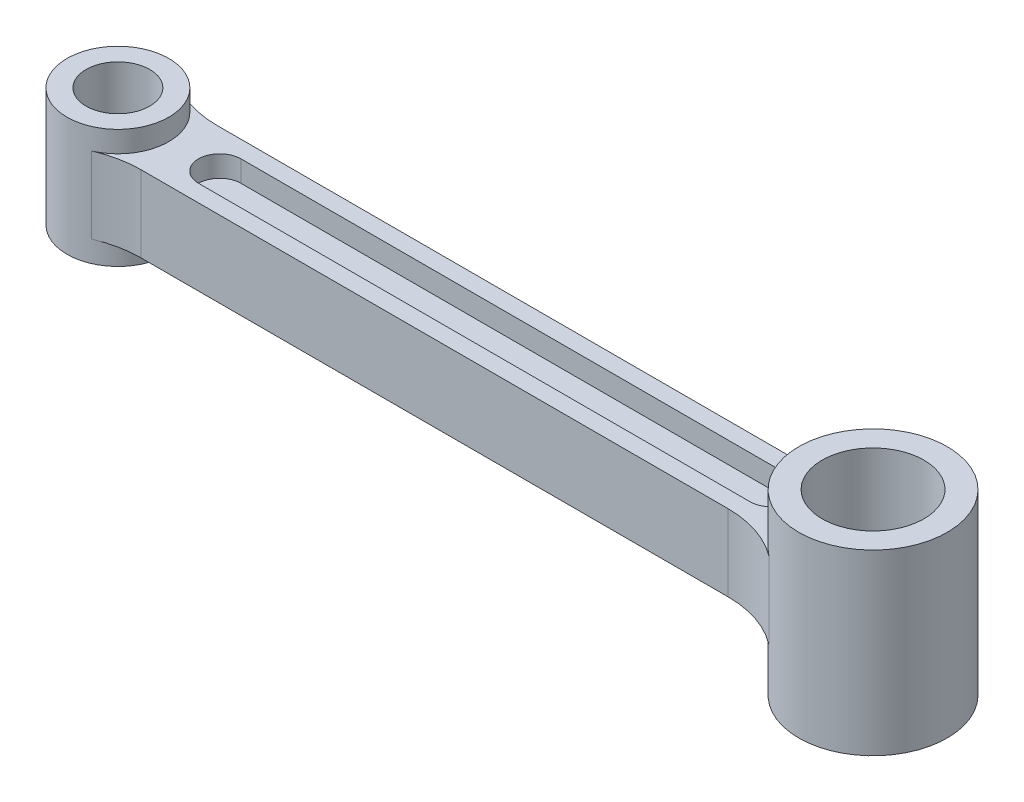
from build123d import *

# Parameters (mm, degrees)
SKETCH1_R      = 12
SKETCH1_R_2    = 7.5
EXTRUDE1_DEPTH = 14
SKETCH1_3_R    = 17.5
SKETCH1_3_R_2  = 12
EXTRUDE2_DEPTH = 21
EXTRUDE3_DEPTH = 9
EXTRUDE4_DEPTH = 5
FILLET1_R      = 24


with BuildPart() as part:
    # Sketch1 → Extrude1 (new, symmetric)
    with BuildSketch(Plane(origin=(0, 0, 0), x_dir=(1, 0, 0), z_dir=(0, 1, 0))):
        with Locations(Location((-89, 0, 0), (0, 0, 270))):
            Circle(SKETCH1_R)
        with Locations(Location((-89, 0, 0), (0, 0, 270))):
            Circle(SKETCH1_R_2, mode=Mode.SUBTRACT)
    extrude(amount=EXTRUDE1_DEPTH, both=True)



with BuildPart() as body_2:
    # Sketch1_3 → Extrude2 (new, symmetric)
    with BuildSketch(Plane(origin=(0, 0, 0), x_dir=(1, 0, 0), z_dir=(0, 1, 0))):
        with Locations(Location((89, 0, 0), (0, 0, 90))):
            Circle(SKETCH1_3_R)
        with Locations(Location((89, 0, 0), (0, 0, 90))):
            Circle(SKETCH1_3_R_2, mode=Mode.SUBTRACT)
    extrude(amount=EXTRUDE2_DEPTH, both=True)


with BuildPart() as part_1:
    add(part.part)

    add(body_2.part)  # Extrude3 merges body 2
    # Sketch1_4 → Extrude3 (add, symmetric)
    with BuildSketch(Plane(origin=(0, 0, 0), x_dir=(1, 0, 0), z_dir=(0, 1, 0))):
        with BuildLine():
            ThreePointArc((-77, 0), (-78.062746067, -4.937253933), (-81.062746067, -9))
            Line((-81.062746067, -9), (73.99166898, -9))
            ThreePointArc((73.99166898, -9), (71.5, 0), (73.99166898, 9))
            Line((73.99166898, 9), (-81.062746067, 9))
            ThreePointArc((-81.062746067, 9), (-78.062746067, 4.937253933), (-77, 0))
        make_face()
    extrude(amount=EXTRUDE3_DEPTH, both=True)

    # Sketch2 → Extrude4 (cut)
    with BuildSketch(Plane(origin=(0, 9, 0), x_dir=(1, 0, 0), z_dir=(0, 1, 0))):
        with BuildLine():
            Line((-65, -5), (65, -5))
            ThreePointArc((65, -5), (70, 0), (65, 5))
            Line((65, 5), (-65, 5))
            ThreePointArc((-65, 5), (-70, 0), (-65, -5))
        make_face()
    extrude4 = extrude(amount=-EXTRUDE4_DEPTH, mode=Mode.SUBTRACT)

    # Mirror1: Extrude4 across plane
    add(extrude4.mirror(Plane.ZX), mode=Mode.SUBTRACT)

    # Fillet1
    fillet1_edges = [part_1.edges().sort_by_distance(p)[0] for p in [
        (73.99166898, 0, 9),
        (73.99166898, 0, -9),
        (-81.062746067, 0, -9),
        (-81.062746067, 0, 9),
    ]]
    fillet(fillet1_edges, radius=FILLET1_R)


solid = part_1.part
